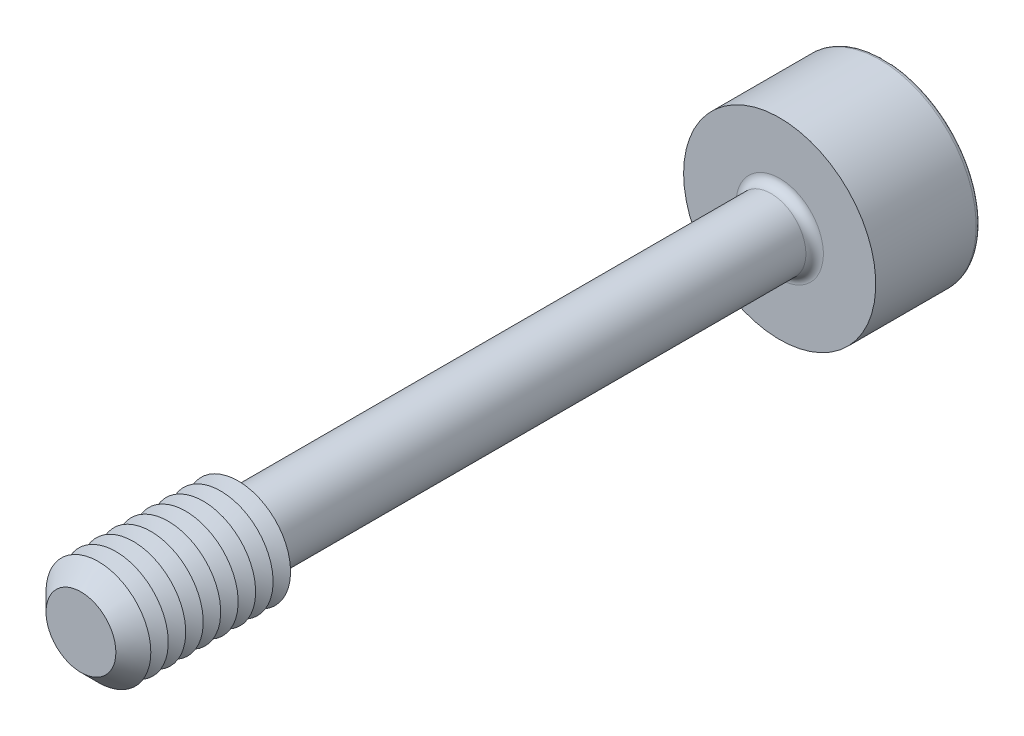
ISO-10303-21;
HEADER;
FILE_DESCRIPTION(('STEP AP214'),'2;1');
FILE_NAME('part.step','',(''),(''),'','','');
FILE_SCHEMA(('AUTOMOTIVE_DESIGN { 1 0 10303 214 1 1 1 1 }'));
ENDSEC;
DATA;
#1=APPLICATION_CONTEXT('core data for automotive mechanical design processes');
#2=APPLICATION_PROTOCOL_DEFINITION('international standard','automotive_design',2000,#1);
#3=PRODUCT_CONTEXT('',#1,'mechanical');
#4=PRODUCT('Part','Part','',(#3));
#5=PRODUCT_RELATED_PRODUCT_CATEGORY('part','',(#4));
#6=PRODUCT_DEFINITION_FORMATION('','',#4);
#7=PRODUCT_DEFINITION_CONTEXT('part definition',#1,'design');
#8=PRODUCT_DEFINITION('design','',#6,#7);
#9=PRODUCT_DEFINITION_SHAPE('','',#8);
#10=(LENGTH_UNIT() NAMED_UNIT(*) SI_UNIT(.MILLI.,.METRE.));
#11=(NAMED_UNIT(*) PLANE_ANGLE_UNIT() SI_UNIT($,.RADIAN.));
#12=(NAMED_UNIT(*) SI_UNIT($,.STERADIAN.) SOLID_ANGLE_UNIT());
#13=UNCERTAINTY_MEASURE_WITH_UNIT(LENGTH_MEASURE(1.E-05),#10,'distance_accuracy_value','');
#14=(GEOMETRIC_REPRESENTATION_CONTEXT(3) GLOBAL_UNCERTAINTY_ASSIGNED_CONTEXT((#13)) GLOBAL_UNIT_ASSIGNED_CONTEXT((#10,
#11,#12)) REPRESENTATION_CONTEXT('',''));
#15=CARTESIAN_POINT('',(0.,0.,0.));
#16=DIRECTION('',(0.,0.,1.));
#17=DIRECTION('',(1.,0.,0.));
#18=AXIS2_PLACEMENT_3D('',#15,#16,#17);
#19=CARTESIAN_POINT('',(-0.721687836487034,-1.25,-10.5));
#20=DIRECTION('',(0.,0.,1.));
#21=DIRECTION('',(1.,0.,0.));
#22=AXIS2_PLACEMENT_3D('',#19,#20,#21);
#23=PLANE('',#22);
#24=DIRECTION('',(1.,0.,0.));
#25=VECTOR('',#24,1.);
#26=CARTESIAN_POINT('',(-0.721687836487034,-1.25,-10.5));
#27=LINE('',#26,#25);
#28=CARTESIAN_POINT('',(0.,-1.25,-10.5));
#29=VERTEX_POINT('',#28);
#30=CARTESIAN_POINT('',(0.721687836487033,-1.25,-10.5));
#31=VERTEX_POINT('',#30);
#32=EDGE_CURVE('E413',#29,#31,#27,.T.);
#33=ORIENTED_EDGE('',*,*,#32,.F.);
#34=CARTESIAN_POINT('',(0.,0.,-10.5));
#35=DIRECTION('',(0.,0.,1.));
#36=DIRECTION('',(0.,-1.,0.));
#37=AXIS2_PLACEMENT_3D('',#34,#35,#36);
#38=CIRCLE('',#37,1.25);
#39=CARTESIAN_POINT('',(1.08253175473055,-0.624999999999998,-10.5));
#40=VERTEX_POINT('',#39);
#41=EDGE_CURVE('E53',#29,#40,#38,.T.);
#42=ORIENTED_EDGE('',*,*,#41,.T.);
#43=DIRECTION('',(0.499999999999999,0.866025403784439,0.));
#44=VECTOR('',#43,1.);
#45=CARTESIAN_POINT('',(0.721687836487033,-1.25,-10.5));
#46=LINE('',#45,#44);
#47=EDGE_CURVE('E402',#31,#40,#46,.T.);
#48=ORIENTED_EDGE('',*,*,#47,.F.);
#49=EDGE_LOOP('',(#33,#42,#48));
#50=FACE_BOUND('',#49,.T.);
#51=ADVANCED_FACE('F41',(#50),#23,.F.);
#52=CARTESIAN_POINT('',(1.44337567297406,0.,-10.5));
#53=VERTEX_POINT('',#52);
#54=EDGE_CURVE('E407',#40,#53,#46,.T.);
#55=ORIENTED_EDGE('',*,*,#54,.F.);
#56=CARTESIAN_POINT('',(1.08253175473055,0.625000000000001,-10.5));
#57=VERTEX_POINT('',#56);
#58=EDGE_CURVE('E11',#40,#57,#38,.T.);
#59=ORIENTED_EDGE('',*,*,#58,.T.);
#60=DIRECTION('',(-0.499999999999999,0.866025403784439,0.));
#61=VECTOR('',#60,1.);
#62=CARTESIAN_POINT('',(1.44337567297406,0.,-10.5));
#63=LINE('',#62,#61);
#64=EDGE_CURVE('E398',#53,#57,#63,.T.);
#65=ORIENTED_EDGE('',*,*,#64,.F.);
#66=EDGE_LOOP('',(#55,#59,#65));
#67=FACE_BOUND('',#66,.T.);
#68=ADVANCED_FACE('F133',(#67),#23,.F.);
#69=CARTESIAN_POINT('',(0.721687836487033,1.25,-10.5));
#70=VERTEX_POINT('',#69);
#71=EDGE_CURVE('E397',#57,#70,#63,.T.);
#72=ORIENTED_EDGE('',*,*,#71,.F.);
#73=CARTESIAN_POINT('',(0.,1.25,-10.5));
#74=VERTEX_POINT('',#73);
#75=EDGE_CURVE('E51',#57,#74,#38,.T.);
#76=ORIENTED_EDGE('',*,*,#75,.T.);
#77=DIRECTION('',(-1.,0.,0.));
#78=VECTOR('',#77,1.);
#79=CARTESIAN_POINT('',(0.721687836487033,1.25,-10.5));
#80=LINE('',#79,#78);
#81=EDGE_CURVE('E177',#70,#74,#80,.T.);
#82=ORIENTED_EDGE('',*,*,#81,.F.);
#83=EDGE_LOOP('',(#72,#76,#82));
#84=FACE_BOUND('',#83,.T.);
#85=ADVANCED_FACE('F139',(#84),#23,.F.);
#86=CARTESIAN_POINT('',(-0.721687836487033,1.25,-10.5));
#87=VERTEX_POINT('',#86);
#88=EDGE_CURVE('E405',#74,#87,#80,.T.);
#89=ORIENTED_EDGE('',*,*,#88,.F.);
#90=CARTESIAN_POINT('',(-1.08253175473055,0.625000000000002,-10.5));
#91=VERTEX_POINT('',#90);
#92=EDGE_CURVE('E262',#74,#91,#38,.T.);
#93=ORIENTED_EDGE('',*,*,#92,.T.);
#94=DIRECTION('',(-0.5,-0.866025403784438,0.));
#95=VECTOR('',#94,1.);
#96=CARTESIAN_POINT('',(-0.721687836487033,1.25,-10.5));
#97=LINE('',#96,#95);
#98=EDGE_CURVE('E176',#87,#91,#97,.T.);
#99=ORIENTED_EDGE('',*,*,#98,.F.);
#100=EDGE_LOOP('',(#89,#93,#99));
#101=FACE_BOUND('',#100,.T.);
#102=ADVANCED_FACE('F157',(#101),#23,.F.);
#103=CARTESIAN_POINT('',(-1.44337567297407,0.,-10.5));
#104=VERTEX_POINT('',#103);
#105=EDGE_CURVE('E170',#91,#104,#97,.T.);
#106=ORIENTED_EDGE('',*,*,#105,.F.);
#107=CARTESIAN_POINT('',(-1.08253175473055,-0.624999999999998,-10.5));
#108=VERTEX_POINT('',#107);
#109=EDGE_CURVE('E172',#91,#108,#38,.T.);
#110=ORIENTED_EDGE('',*,*,#109,.T.);
#111=DIRECTION('',(0.5,-0.866025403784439,0.));
#112=VECTOR('',#111,1.);
#113=CARTESIAN_POINT('',(-1.44337567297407,0.,-10.5));
#114=LINE('',#113,#112);
#115=EDGE_CURVE('E174',#104,#108,#114,.T.);
#116=ORIENTED_EDGE('',*,*,#115,.F.);
#117=EDGE_LOOP('',(#106,#110,#116));
#118=FACE_BOUND('',#117,.T.);
#119=ADVANCED_FACE('F146',(#118),#23,.F.);
#120=CARTESIAN_POINT('',(0.,0.,-13.));
#121=DIRECTION('',(0.,0.,-1.));
#122=DIRECTION('',(-1.,0.,0.));
#123=AXIS2_PLACEMENT_3D('',#120,#121,#122);
#124=PLANE('',#123);
#125=CARTESIAN_POINT('',(0.,0.,-13.));
#126=DIRECTION('',(0.,0.,-1.));
#127=DIRECTION('',(-1.,0.,0.));
#128=AXIS2_PLACEMENT_3D('',#125,#126,#127);
#129=CIRCLE('',#128,2.625);
#130=CARTESIAN_POINT('',(-2.625,0.,-13.));
#131=VERTEX_POINT('',#130);
#132=EDGE_CURVE('E249',#131,#131,#129,.T.);
#133=ORIENTED_EDGE('',*,*,#132,.T.);
#134=EDGE_LOOP('',(#133));
#135=FACE_BOUND('',#134,.T.);
#136=DIRECTION('',(-0.5,-0.866025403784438,0.));
#137=VECTOR('',#136,1.);
#138=CARTESIAN_POINT('',(-0.721687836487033,1.25,-13.));
#139=LINE('',#138,#137);
#140=CARTESIAN_POINT('',(-0.721687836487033,1.25,-13.));
#141=VERTEX_POINT('',#140);
#142=CARTESIAN_POINT('',(-1.44337567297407,0.,-13.));
#143=VERTEX_POINT('',#142);
#144=EDGE_CURVE('E211',#141,#143,#139,.T.);
#145=ORIENTED_EDGE('',*,*,#144,.T.);
#146=DIRECTION('',(0.5,-0.866025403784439,0.));
#147=VECTOR('',#146,1.);
#148=CARTESIAN_POINT('',(-1.44337567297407,0.,-13.));
#149=LINE('',#148,#147);
#150=CARTESIAN_POINT('',(-0.721687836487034,-1.25,-13.));
#151=VERTEX_POINT('',#150);
#152=EDGE_CURVE('E67',#143,#151,#149,.T.);
#153=ORIENTED_EDGE('',*,*,#152,.T.);
#154=DIRECTION('',(1.,0.,0.));
#155=VECTOR('',#154,1.);
#156=CARTESIAN_POINT('',(-0.721687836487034,-1.25,-13.));
#157=LINE('',#156,#155);
#158=CARTESIAN_POINT('',(0.721687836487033,-1.25,-13.));
#159=VERTEX_POINT('',#158);
#160=EDGE_CURVE('E196',#151,#159,#157,.T.);
#161=ORIENTED_EDGE('',*,*,#160,.T.);
#162=DIRECTION('',(0.499999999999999,0.866025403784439,0.));
#163=VECTOR('',#162,1.);
#164=CARTESIAN_POINT('',(0.721687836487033,-1.25,-13.));
#165=LINE('',#164,#163);
#166=CARTESIAN_POINT('',(1.44337567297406,0.,-13.));
#167=VERTEX_POINT('',#166);
#168=EDGE_CURVE('E199',#159,#167,#165,.T.);
#169=ORIENTED_EDGE('',*,*,#168,.T.);
#170=DIRECTION('',(-0.499999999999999,0.866025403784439,0.));
#171=VECTOR('',#170,1.);
#172=CARTESIAN_POINT('',(1.44337567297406,0.,-13.));
#173=LINE('',#172,#171);
#174=CARTESIAN_POINT('',(0.721687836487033,1.25,-13.));
#175=VERTEX_POINT('',#174);
#176=EDGE_CURVE('E203',#167,#175,#173,.T.);
#177=ORIENTED_EDGE('',*,*,#176,.T.);
#178=DIRECTION('',(-1.,0.,0.));
#179=VECTOR('',#178,1.);
#180=CARTESIAN_POINT('',(0.721687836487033,1.25,-13.));
#181=LINE('',#180,#179);
#182=EDGE_CURVE('E207',#175,#141,#181,.T.);
#183=ORIENTED_EDGE('',*,*,#182,.T.);
#184=EDGE_LOOP('',(#145,#153,#161,#169,#177,#183));
#185=FACE_BOUND('',#184,.T.);
#186=ADVANCED_FACE('F156',(#135,#185),#124,.T.);
#187=CARTESIAN_POINT('',(0.,0.,10.));
#188=DIRECTION('',(0.,0.,-1.));
#189=DIRECTION('',(-1.,0.,0.));
#190=AXIS2_PLACEMENT_3D('',#187,#188,#189);
#191=CYLINDRICAL_SURFACE('',#190,1.);
#192=CARTESIAN_POINT('',(0.,0.,-9.75));
#193=DIRECTION('',(0.,0.,-1.));
#194=DIRECTION('',(-1.,0.,0.));
#195=AXIS2_PLACEMENT_3D('',#192,#193,#194);
#196=CIRCLE('',#195,1.);
#197=CARTESIAN_POINT('',(-1.,0.,-9.75));
#198=VERTEX_POINT('',#197);
#199=EDGE_CURVE('E246',#198,#198,#196,.F.);
#200=ORIENTED_EDGE('',*,*,#199,.T.);
#201=EDGE_LOOP('',(#200));
#202=FACE_BOUND('',#201,.T.);
#203=CARTESIAN_POINT('',(0.,0.,5.21132486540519));
#204=DIRECTION('',(0.,0.,-1.));
#205=DIRECTION('',(0.,1.,0.));
#206=AXIS2_PLACEMENT_3D('',#203,#204,#205);
#207=CIRCLE('',#206,1.);
#208=CARTESIAN_POINT('',(0.,1.,5.21132486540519));
#209=VERTEX_POINT('',#208);
#210=EDGE_CURVE('E234',#209,#209,#207,.T.);
#211=ORIENTED_EDGE('',*,*,#210,.T.);
#212=EDGE_LOOP('',(#211));
#213=FACE_BOUND('',#212,.T.);
#214=ADVANCED_FACE('F163',(#202,#213),#191,.T.);
#215=CARTESIAN_POINT('',(0.,0.,5.21132486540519));
#216=DIRECTION('',(0.,0.,1.));
#217=DIRECTION('',(0.,-1.,0.));
#218=AXIS2_PLACEMENT_3D('',#215,#216,#217);
#219=CONICAL_SURFACE('',#218,1.,1.0471975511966);
#220=CARTESIAN_POINT('',(0.,0.,5.5));
#221=DIRECTION('',(0.,0.,-1.));
#222=DIRECTION('',(-1.,0.,0.));
#223=AXIS2_PLACEMENT_3D('',#220,#221,#222);
#224=CIRCLE('',#223,1.5);
#225=CARTESIAN_POINT('',(-1.5,0.,5.5));
#226=VERTEX_POINT('',#225);
#227=EDGE_CURVE('E266',#226,#226,#224,.T.);
#228=ORIENTED_EDGE('',*,*,#227,.T.);
#229=EDGE_LOOP('',(#228));
#230=FACE_BOUND('',#229,.T.);
#231=ORIENTED_EDGE('',*,*,#210,.F.);
#232=EDGE_LOOP('',(#231));
#233=FACE_BOUND('',#232,.T.);
#234=ADVANCED_FACE('F355',(#230,#233),#219,.T.);
#235=CARTESIAN_POINT('',(0.,0.,-10.));
#236=DIRECTION('',(0.,0.,-1.));
#237=DIRECTION('',(-1.,0.,0.));
#238=AXIS2_PLACEMENT_3D('',#235,#236,#237);
#239=PLANE('',#238);
#240=CARTESIAN_POINT('',(0.,0.,-10.));
#241=DIRECTION('',(0.,0.,-1.));
#242=DIRECTION('',(-1.,0.,0.));
#243=AXIS2_PLACEMENT_3D('',#240,#241,#242);
#244=CIRCLE('',#243,1.25);
#245=CARTESIAN_POINT('',(-1.25,0.,-10.));
#246=VERTEX_POINT('',#245);
#247=EDGE_CURVE('E242',#246,#246,#244,.T.);
#248=ORIENTED_EDGE('',*,*,#247,.T.);
#249=EDGE_LOOP('',(#248));
#250=FACE_BOUND('',#249,.T.);
#251=CARTESIAN_POINT('',(0.,0.,-10.));
#252=DIRECTION('',(0.,0.,-1.));
#253=DIRECTION('',(-1.,0.,0.));
#254=AXIS2_PLACEMENT_3D('',#251,#252,#253);
#255=CIRCLE('',#254,2.75);
#256=CARTESIAN_POINT('',(-2.75,0.,-10.));
#257=VERTEX_POINT('',#256);
#258=EDGE_CURVE('E230',#257,#257,#255,.T.);
#259=ORIENTED_EDGE('',*,*,#258,.F.);
#260=EDGE_LOOP('',(#259));
#261=FACE_BOUND('',#260,.T.);
#262=ADVANCED_FACE('F360',(#250,#261),#239,.F.);
#263=CARTESIAN_POINT('',(0.,0.,-13.));
#264=DIRECTION('',(0.,0.,1.));
#265=DIRECTION('',(1.,0.,0.));
#266=AXIS2_PLACEMENT_3D('',#263,#264,#265);
#267=CYLINDRICAL_SURFACE('',#266,2.75);
#268=CARTESIAN_POINT('',(0.,0.,-12.875));
#269=DIRECTION('',(0.,0.,-1.));
#270=DIRECTION('',(-1.,0.,0.));
#271=AXIS2_PLACEMENT_3D('',#268,#269,#270);
#272=CIRCLE('',#271,2.75);
#273=CARTESIAN_POINT('',(-2.75,0.,-12.875));
#274=VERTEX_POINT('',#273);
#275=EDGE_CURVE('E45',#274,#274,#272,.F.);
#276=ORIENTED_EDGE('',*,*,#275,.T.);
#277=EDGE_LOOP('',(#276));
#278=FACE_BOUND('',#277,.T.);
#279=ORIENTED_EDGE('',*,*,#258,.T.);
#280=EDGE_LOOP('',(#279));
#281=FACE_BOUND('',#280,.T.);
#282=ADVANCED_FACE('F361',(#278,#281),#267,.T.);
#283=CARTESIAN_POINT('',(-1.44337567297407,0.,-10.5));
#284=DIRECTION('',(0.866025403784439,0.5,0.));
#285=DIRECTION('',(-0.5,0.866025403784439,0.));
#286=AXIS2_PLACEMENT_3D('',#283,#284,#285);
#287=PLANE('',#286);
#288=ORIENTED_EDGE('',*,*,#152,.F.);
#289=DIRECTION('',(0.,0.,-1.));
#290=VECTOR('',#289,1.);
#291=CARTESIAN_POINT('',(-1.44337567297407,0.,-10.5));
#292=LINE('',#291,#290);
#293=EDGE_CURVE('E186',#104,#143,#292,.T.);
#294=ORIENTED_EDGE('',*,*,#293,.F.);
#295=ORIENTED_EDGE('',*,*,#115,.T.);
#296=CARTESIAN_POINT('',(-0.721687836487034,-1.25,-10.5));
#297=VERTEX_POINT('',#296);
#298=EDGE_CURVE('E214',#108,#297,#114,.T.);
#299=ORIENTED_EDGE('',*,*,#298,.T.);
#300=DIRECTION('',(0.,0.,-1.));
#301=VECTOR('',#300,1.);
#302=CARTESIAN_POINT('',(-0.721687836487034,-1.25,-10.5));
#303=LINE('',#302,#301);
#304=EDGE_CURVE('E227',#297,#151,#303,.T.);
#305=ORIENTED_EDGE('',*,*,#304,.T.);
#306=EDGE_LOOP('',(#288,#294,#295,#299,#305));
#307=FACE_BOUND('',#306,.T.);
#308=ADVANCED_FACE('F364',(#307),#287,.T.);
#309=CARTESIAN_POINT('',(-0.721687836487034,-1.25,-10.5));
#310=DIRECTION('',(0.,1.,0.));
#311=DIRECTION('',(0.,0.,1.));
#312=AXIS2_PLACEMENT_3D('',#309,#310,#311);
#313=PLANE('',#312);
#314=ORIENTED_EDGE('',*,*,#160,.F.);
#315=ORIENTED_EDGE('',*,*,#304,.F.);
#316=EDGE_CURVE('E410',#297,#29,#27,.T.);
#317=ORIENTED_EDGE('',*,*,#316,.T.);
#318=ORIENTED_EDGE('',*,*,#32,.T.);
#319=DIRECTION('',(0.,0.,-1.));
#320=VECTOR('',#319,1.);
#321=CARTESIAN_POINT('',(0.721687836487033,-1.25,-10.5));
#322=LINE('',#321,#320);
#323=EDGE_CURVE('E224',#31,#159,#322,.T.);
#324=ORIENTED_EDGE('',*,*,#323,.T.);
#325=EDGE_LOOP('',(#314,#315,#317,#318,#324));
#326=FACE_BOUND('',#325,.T.);
#327=ADVANCED_FACE('F370',(#326),#313,.T.);
#328=CARTESIAN_POINT('',(0.721687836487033,-1.25,-10.5));
#329=DIRECTION('',(-0.866025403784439,0.499999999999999,0.));
#330=DIRECTION('',(-0.499999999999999,-0.866025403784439,0.));
#331=AXIS2_PLACEMENT_3D('',#328,#329,#330);
#332=PLANE('',#331);
#333=ORIENTED_EDGE('',*,*,#168,.F.);
#334=ORIENTED_EDGE('',*,*,#323,.F.);
#335=ORIENTED_EDGE('',*,*,#47,.T.);
#336=ORIENTED_EDGE('',*,*,#54,.T.);
#337=DIRECTION('',(0.,0.,-1.));
#338=VECTOR('',#337,1.);
#339=CARTESIAN_POINT('',(1.44337567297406,0.,-10.5));
#340=LINE('',#339,#338);
#341=EDGE_CURVE('E221',#53,#167,#340,.T.);
#342=ORIENTED_EDGE('',*,*,#341,.T.);
#343=EDGE_LOOP('',(#333,#334,#335,#336,#342));
#344=FACE_BOUND('',#343,.T.);
#345=ADVANCED_FACE('F373',(#344),#332,.T.);
#346=CARTESIAN_POINT('',(1.44337567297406,0.,-10.5));
#347=DIRECTION('',(-0.866025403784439,-0.5,0.));
#348=DIRECTION('',(0.5,-0.866025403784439,0.));
#349=AXIS2_PLACEMENT_3D('',#346,#347,#348);
#350=PLANE('',#349);
#351=ORIENTED_EDGE('',*,*,#176,.F.);
#352=ORIENTED_EDGE('',*,*,#341,.F.);
#353=ORIENTED_EDGE('',*,*,#64,.T.);
#354=ORIENTED_EDGE('',*,*,#71,.T.);
#355=DIRECTION('',(0.,0.,-1.));
#356=VECTOR('',#355,1.);
#357=CARTESIAN_POINT('',(0.721687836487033,1.25,-10.5));
#358=LINE('',#357,#356);
#359=EDGE_CURVE('E218',#70,#175,#358,.T.);
#360=ORIENTED_EDGE('',*,*,#359,.T.);
#361=EDGE_LOOP('',(#351,#352,#353,#354,#360));
#362=FACE_BOUND('',#361,.T.);
#363=ADVANCED_FACE('F377',(#362),#350,.T.);
#364=CARTESIAN_POINT('',(0.721687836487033,1.25,-10.5));
#365=DIRECTION('',(0.,-1.,0.));
#366=DIRECTION('',(1.,0.,0.));
#367=AXIS2_PLACEMENT_3D('',#364,#365,#366);
#368=PLANE('',#367);
#369=ORIENTED_EDGE('',*,*,#182,.F.);
#370=ORIENTED_EDGE('',*,*,#359,.F.);
#371=ORIENTED_EDGE('',*,*,#81,.T.);
#372=ORIENTED_EDGE('',*,*,#88,.T.);
#373=DIRECTION('',(0.,0.,-1.));
#374=VECTOR('',#373,1.);
#375=CARTESIAN_POINT('',(-0.721687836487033,1.25,-10.5));
#376=LINE('',#375,#374);
#377=EDGE_CURVE('E182',#87,#141,#376,.T.);
#378=ORIENTED_EDGE('',*,*,#377,.T.);
#379=EDGE_LOOP('',(#369,#370,#371,#372,#378));
#380=FACE_BOUND('',#379,.T.);
#381=ADVANCED_FACE('F152',(#380),#368,.T.);
#382=CARTESIAN_POINT('',(-0.721687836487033,1.25,-10.5));
#383=DIRECTION('',(0.866025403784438,-0.5,0.));
#384=DIRECTION('',(0.5,0.866025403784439,0.));
#385=AXIS2_PLACEMENT_3D('',#382,#383,#384);
#386=PLANE('',#385);
#387=ORIENTED_EDGE('',*,*,#144,.F.);
#388=ORIENTED_EDGE('',*,*,#377,.F.);
#389=ORIENTED_EDGE('',*,*,#98,.T.);
#390=ORIENTED_EDGE('',*,*,#105,.T.);
#391=ORIENTED_EDGE('',*,*,#293,.T.);
#392=EDGE_LOOP('',(#387,#388,#389,#390,#391));
#393=FACE_BOUND('',#392,.T.);
#394=ADVANCED_FACE('F144',(#393),#386,.T.);
#395=ORIENTED_EDGE('',*,*,#298,.F.);
#396=EDGE_CURVE('E256',#108,#29,#38,.T.);
#397=ORIENTED_EDGE('',*,*,#396,.T.);
#398=ORIENTED_EDGE('',*,*,#316,.F.);
#399=EDGE_LOOP('',(#395,#397,#398));
#400=FACE_BOUND('',#399,.T.);
#401=ADVANCED_FACE('F135',(#400),#23,.F.);
#402=CARTESIAN_POINT('',(0.,0.,-9.75));
#403=DIRECTION('',(0.,0.,-1.));
#404=DIRECTION('',(-1.,0.,0.));
#405=AXIS2_PLACEMENT_3D('',#402,#403,#404);
#406=TOROIDAL_SURFACE('',#405,1.25,0.25);
#407=ORIENTED_EDGE('',*,*,#199,.F.);
#408=EDGE_LOOP('',(#407));
#409=FACE_BOUND('',#408,.T.);
#410=ORIENTED_EDGE('',*,*,#247,.F.);
#411=EDGE_LOOP('',(#410));
#412=FACE_BOUND('',#411,.T.);
#413=ADVANCED_FACE('F129',(#409,#412),#406,.F.);
#414=CARTESIAN_POINT('',(0.,0.,-12.875));
#415=DIRECTION('',(0.,0.,-1.));
#416=DIRECTION('',(-1.,0.,0.));
#417=AXIS2_PLACEMENT_3D('',#414,#415,#416);
#418=TOROIDAL_SURFACE('',#417,2.625,0.125);
#419=ORIENTED_EDGE('',*,*,#275,.F.);
#420=EDGE_LOOP('',(#419));
#421=FACE_BOUND('',#420,.T.);
#422=ORIENTED_EDGE('',*,*,#132,.F.);
#423=EDGE_LOOP('',(#422));
#424=FACE_BOUND('',#423,.T.);
#425=ADVANCED_FACE('F43',(#421,#424),#418,.T.);
#426=CARTESIAN_POINT('',(0.,0.,-9.77831216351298));
#427=DIRECTION('',(0.,0.,-1.));
#428=DIRECTION('',(0.,1.,0.));
#429=AXIS2_PLACEMENT_3D('',#426,#427,#428);
#430=CONICAL_SURFACE('',#429,0.,1.0471975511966);
#431=ORIENTED_EDGE('',*,*,#41,.F.);
#432=ORIENTED_EDGE('',*,*,#396,.F.);
#433=ORIENTED_EDGE('',*,*,#109,.F.);
#434=ORIENTED_EDGE('',*,*,#92,.F.);
#435=ORIENTED_EDGE('',*,*,#75,.F.);
#436=ORIENTED_EDGE('',*,*,#58,.F.);
#437=EDGE_LOOP('',(#431,#432,#433,#434,#435,#436));
#438=FACE_BOUND('',#437,.T.);
#439=CARTESIAN_POINT('',(0.,0.,-9.77831216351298));
#440=VERTEX_POINT('',#439);
#441=VERTEX_LOOP('',#440);
#442=FACE_BOUND('',#441,.T.);
#443=ADVANCED_FACE('F118',(#438,#442),#430,.F.);
#444=CARTESIAN_POINT('',(0.,0.,5.75));
#445=DIRECTION('',(0.,0.,-1.));
#446=DIRECTION('',(-1.,0.,0.));
#447=AXIS2_PLACEMENT_3D('',#444,#445,#446);
#448=CONICAL_SURFACE('',#447,1.06698729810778,1.0471975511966);
#449=ORIENTED_EDGE('',*,*,#227,.F.);
#450=EDGE_LOOP('',(#449));
#451=FACE_BOUND('',#450,.T.);
#452=CARTESIAN_POINT('',(0.,0.,5.75));
#453=DIRECTION('',(0.,0.,-1.));
#454=DIRECTION('',(-1.,0.,0.));
#455=AXIS2_PLACEMENT_3D('',#452,#453,#454);
#456=CIRCLE('',#455,1.06698729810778);
#457=CARTESIAN_POINT('',(-1.06698729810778,0.,5.75));
#458=VERTEX_POINT('',#457);
#459=EDGE_CURVE('E272',#458,#458,#456,.T.);
#460=ORIENTED_EDGE('',*,*,#459,.T.);
#461=EDGE_LOOP('',(#460));
#462=FACE_BOUND('',#461,.T.);
#463=ADVANCED_FACE('F120',(#451,#462),#448,.T.);
#464=CARTESIAN_POINT('',(0.,0.,6.));
#465=DIRECTION('',(0.,0.,1.));
#466=DIRECTION('',(1.,0.,0.));
#467=AXIS2_PLACEMENT_3D('',#464,#465,#466);
#468=CONICAL_SURFACE('',#467,1.5,1.0471975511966);
#469=ORIENTED_EDGE('',*,*,#459,.F.);
#470=EDGE_LOOP('',(#469));
#471=FACE_BOUND('',#470,.T.);
#472=CARTESIAN_POINT('',(0.,0.,6.));
#473=DIRECTION('',(0.,0.,-1.));
#474=DIRECTION('',(-1.,0.,0.));
#475=AXIS2_PLACEMENT_3D('',#472,#473,#474);
#476=CIRCLE('',#475,1.5);
#477=CARTESIAN_POINT('',(-1.5,0.,6.));
#478=VERTEX_POINT('',#477);
#479=EDGE_CURVE('E278',#478,#478,#476,.T.);
#480=ORIENTED_EDGE('',*,*,#479,.T.);
#481=EDGE_LOOP('',(#480));
#482=FACE_BOUND('',#481,.T.);
#483=ADVANCED_FACE('F126',(#471,#482),#468,.T.);
#484=CARTESIAN_POINT('',(0.,0.,6.25));
#485=DIRECTION('',(0.,0.,-1.));
#486=DIRECTION('',(-1.,0.,0.));
#487=AXIS2_PLACEMENT_3D('',#484,#485,#486);
#488=CONICAL_SURFACE('',#487,1.06698729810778,1.0471975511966);
#489=ORIENTED_EDGE('',*,*,#479,.F.);
#490=EDGE_LOOP('',(#489));
#491=FACE_BOUND('',#490,.T.);
#492=CARTESIAN_POINT('',(0.,0.,6.25));
#493=DIRECTION('',(0.,0.,-1.));
#494=DIRECTION('',(-1.,0.,0.));
#495=AXIS2_PLACEMENT_3D('',#492,#493,#494);
#496=CIRCLE('',#495,1.06698729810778);
#497=CARTESIAN_POINT('',(-1.06698729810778,0.,6.25));
#498=VERTEX_POINT('',#497);
#499=EDGE_CURVE('E284',#498,#498,#496,.T.);
#500=ORIENTED_EDGE('',*,*,#499,.T.);
#501=EDGE_LOOP('',(#500));
#502=FACE_BOUND('',#501,.T.);
#503=ADVANCED_FACE('F516',(#491,#502),#488,.T.);
#504=CARTESIAN_POINT('',(0.,0.,6.5));
#505=DIRECTION('',(0.,0.,1.));
#506=DIRECTION('',(1.,0.,0.));
#507=AXIS2_PLACEMENT_3D('',#504,#505,#506);
#508=CONICAL_SURFACE('',#507,1.5,1.0471975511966);
#509=ORIENTED_EDGE('',*,*,#499,.F.);
#510=EDGE_LOOP('',(#509));
#511=FACE_BOUND('',#510,.T.);
#512=CARTESIAN_POINT('',(0.,0.,6.5));
#513=DIRECTION('',(0.,0.,-1.));
#514=DIRECTION('',(-1.,0.,0.));
#515=AXIS2_PLACEMENT_3D('',#512,#513,#514);
#516=CIRCLE('',#515,1.5);
#517=CARTESIAN_POINT('',(-1.5,0.,6.5));
#518=VERTEX_POINT('',#517);
#519=EDGE_CURVE('E288',#518,#518,#516,.T.);
#520=ORIENTED_EDGE('',*,*,#519,.T.);
#521=EDGE_LOOP('',(#520));
#522=FACE_BOUND('',#521,.T.);
#523=ADVANCED_FACE('F525',(#511,#522),#508,.T.);
#524=CARTESIAN_POINT('',(0.,0.,6.75));
#525=DIRECTION('',(0.,0.,-1.));
#526=DIRECTION('',(-1.,0.,0.));
#527=AXIS2_PLACEMENT_3D('',#524,#525,#526);
#528=CONICAL_SURFACE('',#527,1.06698729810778,1.0471975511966);
#529=ORIENTED_EDGE('',*,*,#519,.F.);
#530=EDGE_LOOP('',(#529));
#531=FACE_BOUND('',#530,.T.);
#532=CARTESIAN_POINT('',(0.,0.,6.75));
#533=DIRECTION('',(0.,0.,-1.));
#534=DIRECTION('',(-1.,0.,0.));
#535=AXIS2_PLACEMENT_3D('',#532,#533,#534);
#536=CIRCLE('',#535,1.06698729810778);
#537=CARTESIAN_POINT('',(-1.06698729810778,0.,6.75));
#538=VERTEX_POINT('',#537);
#539=EDGE_CURVE('E292',#538,#538,#536,.T.);
#540=ORIENTED_EDGE('',*,*,#539,.T.);
#541=EDGE_LOOP('',(#540));
#542=FACE_BOUND('',#541,.T.);
#543=ADVANCED_FACE('F534',(#531,#542),#528,.T.);
#544=CARTESIAN_POINT('',(0.,0.,7.));
#545=DIRECTION('',(0.,0.,1.));
#546=DIRECTION('',(1.,0.,0.));
#547=AXIS2_PLACEMENT_3D('',#544,#545,#546);
#548=CONICAL_SURFACE('',#547,1.5,1.0471975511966);
#549=ORIENTED_EDGE('',*,*,#539,.F.);
#550=EDGE_LOOP('',(#549));
#551=FACE_BOUND('',#550,.T.);
#552=CARTESIAN_POINT('',(0.,0.,7.));
#553=DIRECTION('',(0.,0.,-1.));
#554=DIRECTION('',(-1.,0.,0.));
#555=AXIS2_PLACEMENT_3D('',#552,#553,#554);
#556=CIRCLE('',#555,1.5);
#557=CARTESIAN_POINT('',(-1.5,0.,7.));
#558=VERTEX_POINT('',#557);
#559=EDGE_CURVE('E295',#558,#558,#556,.T.);
#560=ORIENTED_EDGE('',*,*,#559,.T.);
#561=EDGE_LOOP('',(#560));
#562=FACE_BOUND('',#561,.T.);
#563=ADVANCED_FACE('F543',(#551,#562),#548,.T.);
#564=CARTESIAN_POINT('',(0.,0.,7.25));
#565=DIRECTION('',(0.,0.,-1.));
#566=DIRECTION('',(-1.,0.,0.));
#567=AXIS2_PLACEMENT_3D('',#564,#565,#566);
#568=CONICAL_SURFACE('',#567,1.06698729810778,1.0471975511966);
#569=ORIENTED_EDGE('',*,*,#559,.F.);
#570=EDGE_LOOP('',(#569));
#571=FACE_BOUND('',#570,.T.);
#572=CARTESIAN_POINT('',(0.,0.,7.25));
#573=DIRECTION('',(0.,0.,-1.));
#574=DIRECTION('',(-1.,0.,0.));
#575=AXIS2_PLACEMENT_3D('',#572,#573,#574);
#576=CIRCLE('',#575,1.06698729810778);
#577=CARTESIAN_POINT('',(-1.06698729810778,0.,7.25));
#578=VERTEX_POINT('',#577);
#579=EDGE_CURVE('E299',#578,#578,#576,.T.);
#580=ORIENTED_EDGE('',*,*,#579,.T.);
#581=EDGE_LOOP('',(#580));
#582=FACE_BOUND('',#581,.T.);
#583=ADVANCED_FACE('F552',(#571,#582),#568,.T.);
#584=CARTESIAN_POINT('',(0.,0.,7.5));
#585=DIRECTION('',(0.,0.,1.));
#586=DIRECTION('',(1.,0.,0.));
#587=AXIS2_PLACEMENT_3D('',#584,#585,#586);
#588=CONICAL_SURFACE('',#587,1.5,1.0471975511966);
#589=ORIENTED_EDGE('',*,*,#579,.F.);
#590=EDGE_LOOP('',(#589));
#591=FACE_BOUND('',#590,.T.);
#592=CARTESIAN_POINT('',(0.,0.,7.5));
#593=DIRECTION('',(0.,0.,-1.));
#594=DIRECTION('',(-1.,0.,0.));
#595=AXIS2_PLACEMENT_3D('',#592,#593,#594);
#596=CIRCLE('',#595,1.5);
#597=CARTESIAN_POINT('',(-1.5,0.,7.5));
#598=VERTEX_POINT('',#597);
#599=EDGE_CURVE('E303',#598,#598,#596,.T.);
#600=ORIENTED_EDGE('',*,*,#599,.T.);
#601=EDGE_LOOP('',(#600));
#602=FACE_BOUND('',#601,.T.);
#603=ADVANCED_FACE('F561',(#591,#602),#588,.T.);
#604=CARTESIAN_POINT('',(0.,0.,7.75));
#605=DIRECTION('',(0.,0.,-1.));
#606=DIRECTION('',(-1.,0.,0.));
#607=AXIS2_PLACEMENT_3D('',#604,#605,#606);
#608=CONICAL_SURFACE('',#607,1.06698729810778,1.0471975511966);
#609=ORIENTED_EDGE('',*,*,#599,.F.);
#610=EDGE_LOOP('',(#609));
#611=FACE_BOUND('',#610,.T.);
#612=CARTESIAN_POINT('',(0.,0.,7.75));
#613=DIRECTION('',(0.,0.,-1.));
#614=DIRECTION('',(-1.,0.,0.));
#615=AXIS2_PLACEMENT_3D('',#612,#613,#614);
#616=CIRCLE('',#615,1.06698729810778);
#617=CARTESIAN_POINT('',(-1.06698729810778,0.,7.75));
#618=VERTEX_POINT('',#617);
#619=EDGE_CURVE('E307',#618,#618,#616,.T.);
#620=ORIENTED_EDGE('',*,*,#619,.T.);
#621=EDGE_LOOP('',(#620));
#622=FACE_BOUND('',#621,.T.);
#623=ADVANCED_FACE('F570',(#611,#622),#608,.T.);
#624=CARTESIAN_POINT('',(0.,0.,8.));
#625=DIRECTION('',(0.,0.,1.));
#626=DIRECTION('',(1.,0.,0.));
#627=AXIS2_PLACEMENT_3D('',#624,#625,#626);
#628=CONICAL_SURFACE('',#627,1.5,1.0471975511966);
#629=ORIENTED_EDGE('',*,*,#619,.F.);
#630=EDGE_LOOP('',(#629));
#631=FACE_BOUND('',#630,.T.);
#632=CARTESIAN_POINT('',(0.,0.,8.));
#633=DIRECTION('',(0.,0.,-1.));
#634=DIRECTION('',(-1.,0.,0.));
#635=AXIS2_PLACEMENT_3D('',#632,#633,#634);
#636=CIRCLE('',#635,1.5);
#637=CARTESIAN_POINT('',(-1.5,0.,8.));
#638=VERTEX_POINT('',#637);
#639=EDGE_CURVE('E311',#638,#638,#636,.T.);
#640=ORIENTED_EDGE('',*,*,#639,.T.);
#641=EDGE_LOOP('',(#640));
#642=FACE_BOUND('',#641,.T.);
#643=ADVANCED_FACE('F579',(#631,#642),#628,.T.);
#644=CARTESIAN_POINT('',(0.,0.,8.25));
#645=DIRECTION('',(0.,0.,-1.));
#646=DIRECTION('',(-1.,0.,0.));
#647=AXIS2_PLACEMENT_3D('',#644,#645,#646);
#648=CONICAL_SURFACE('',#647,1.06698729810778,1.0471975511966);
#649=ORIENTED_EDGE('',*,*,#639,.F.);
#650=EDGE_LOOP('',(#649));
#651=FACE_BOUND('',#650,.T.);
#652=CARTESIAN_POINT('',(0.,0.,8.25));
#653=DIRECTION('',(0.,0.,-1.));
#654=DIRECTION('',(-1.,0.,0.));
#655=AXIS2_PLACEMENT_3D('',#652,#653,#654);
#656=CIRCLE('',#655,1.06698729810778);
#657=CARTESIAN_POINT('',(-1.06698729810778,0.,8.25));
#658=VERTEX_POINT('',#657);
#659=EDGE_CURVE('E314',#658,#658,#656,.T.);
#660=ORIENTED_EDGE('',*,*,#659,.T.);
#661=EDGE_LOOP('',(#660));
#662=FACE_BOUND('',#661,.T.);
#663=ADVANCED_FACE('F588',(#651,#662),#648,.T.);
#664=CARTESIAN_POINT('',(0.,0.,8.5));
#665=DIRECTION('',(0.,0.,1.));
#666=DIRECTION('',(1.,0.,0.));
#667=AXIS2_PLACEMENT_3D('',#664,#665,#666);
#668=CONICAL_SURFACE('',#667,1.5,1.0471975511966);
#669=ORIENTED_EDGE('',*,*,#659,.F.);
#670=EDGE_LOOP('',(#669));
#671=FACE_BOUND('',#670,.T.);
#672=CARTESIAN_POINT('',(0.,0.,8.5));
#673=DIRECTION('',(0.,0.,-1.));
#674=DIRECTION('',(-1.,0.,0.));
#675=AXIS2_PLACEMENT_3D('',#672,#673,#674);
#676=CIRCLE('',#675,1.5);
#677=CARTESIAN_POINT('',(-1.5,0.,8.5));
#678=VERTEX_POINT('',#677);
#679=EDGE_CURVE('E318',#678,#678,#676,.T.);
#680=ORIENTED_EDGE('',*,*,#679,.T.);
#681=EDGE_LOOP('',(#680));
#682=FACE_BOUND('',#681,.T.);
#683=ADVANCED_FACE('F597',(#671,#682),#668,.T.);
#684=CARTESIAN_POINT('',(0.,0.,8.75));
#685=DIRECTION('',(0.,0.,-1.));
#686=DIRECTION('',(-1.,0.,0.));
#687=AXIS2_PLACEMENT_3D('',#684,#685,#686);
#688=CONICAL_SURFACE('',#687,1.06698729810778,1.0471975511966);
#689=ORIENTED_EDGE('',*,*,#679,.F.);
#690=EDGE_LOOP('',(#689));
#691=FACE_BOUND('',#690,.T.);
#692=CARTESIAN_POINT('',(0.,0.,8.75));
#693=DIRECTION('',(0.,0.,-1.));
#694=DIRECTION('',(-1.,0.,0.));
#695=AXIS2_PLACEMENT_3D('',#692,#693,#694);
#696=CIRCLE('',#695,1.06698729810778);
#697=CARTESIAN_POINT('',(-1.06698729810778,0.,8.75));
#698=VERTEX_POINT('',#697);
#699=EDGE_CURVE('E322',#698,#698,#696,.T.);
#700=ORIENTED_EDGE('',*,*,#699,.T.);
#701=EDGE_LOOP('',(#700));
#702=FACE_BOUND('',#701,.T.);
#703=ADVANCED_FACE('F606',(#691,#702),#688,.T.);
#704=CARTESIAN_POINT('',(0.,0.,9.));
#705=DIRECTION('',(0.,0.,1.));
#706=DIRECTION('',(1.,0.,0.));
#707=AXIS2_PLACEMENT_3D('',#704,#705,#706);
#708=CONICAL_SURFACE('',#707,1.5,1.0471975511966);
#709=ORIENTED_EDGE('',*,*,#699,.F.);
#710=EDGE_LOOP('',(#709));
#711=FACE_BOUND('',#710,.T.);
#712=CARTESIAN_POINT('',(0.,0.,9.));
#713=DIRECTION('',(0.,0.,-1.));
#714=DIRECTION('',(-1.,0.,0.));
#715=AXIS2_PLACEMENT_3D('',#712,#713,#714);
#716=CIRCLE('',#715,1.5);
#717=CARTESIAN_POINT('',(-1.5,0.,9.));
#718=VERTEX_POINT('',#717);
#719=EDGE_CURVE('E326',#718,#718,#716,.T.);
#720=ORIENTED_EDGE('',*,*,#719,.T.);
#721=EDGE_LOOP('',(#720));
#722=FACE_BOUND('',#721,.T.);
#723=ADVANCED_FACE('F615',(#711,#722),#708,.T.);
#724=CARTESIAN_POINT('',(0.,0.,9.25));
#725=DIRECTION('',(0.,0.,-1.));
#726=DIRECTION('',(-1.,0.,0.));
#727=AXIS2_PLACEMENT_3D('',#724,#725,#726);
#728=CONICAL_SURFACE('',#727,1.06698729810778,1.0471975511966);
#729=ORIENTED_EDGE('',*,*,#719,.F.);
#730=EDGE_LOOP('',(#729));
#731=FACE_BOUND('',#730,.T.);
#732=CARTESIAN_POINT('',(0.,0.,9.25));
#733=DIRECTION('',(0.,0.,-1.));
#734=DIRECTION('',(-1.,0.,0.));
#735=AXIS2_PLACEMENT_3D('',#732,#733,#734);
#736=CIRCLE('',#735,1.06698729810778);
#737=CARTESIAN_POINT('',(-1.06698729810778,0.,9.25));
#738=VERTEX_POINT('',#737);
#739=EDGE_CURVE('E330',#738,#738,#736,.T.);
#740=ORIENTED_EDGE('',*,*,#739,.T.);
#741=EDGE_LOOP('',(#740));
#742=FACE_BOUND('',#741,.T.);
#743=ADVANCED_FACE('F624',(#731,#742),#728,.T.);
#744=CARTESIAN_POINT('',(0.,0.,9.5));
#745=DIRECTION('',(0.,0.,1.));
#746=DIRECTION('',(1.,0.,0.));
#747=AXIS2_PLACEMENT_3D('',#744,#745,#746);
#748=CONICAL_SURFACE('',#747,1.5,1.0471975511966);
#749=ORIENTED_EDGE('',*,*,#739,.F.);
#750=EDGE_LOOP('',(#749));
#751=FACE_BOUND('',#750,.T.);
#752=CARTESIAN_POINT('',(0.,0.,9.5));
#753=DIRECTION('',(0.,0.,-1.));
#754=DIRECTION('',(-1.,0.,0.));
#755=AXIS2_PLACEMENT_3D('',#752,#753,#754);
#756=CIRCLE('',#755,1.5);
#757=CARTESIAN_POINT('',(-1.5,0.,9.5));
#758=VERTEX_POINT('',#757);
#759=EDGE_CURVE('E334',#758,#758,#756,.T.);
#760=ORIENTED_EDGE('',*,*,#759,.T.);
#761=EDGE_LOOP('',(#760));
#762=FACE_BOUND('',#761,.T.);
#763=ADVANCED_FACE('F340',(#751,#762),#748,.T.);
#764=CARTESIAN_POINT('',(0.,0.,10.));
#765=DIRECTION('',(0.,0.,1.));
#766=DIRECTION('',(1.,0.,0.));
#767=AXIS2_PLACEMENT_3D('',#764,#765,#766);
#768=PLANE('',#767);
#769=CARTESIAN_POINT('',(0.,0.,10.));
#770=DIRECTION('',(0.,0.,1.));
#771=DIRECTION('',(1.,0.,0.));
#772=AXIS2_PLACEMENT_3D('',#769,#770,#771);
#773=CIRCLE('',#772,0.999999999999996);
#774=CARTESIAN_POINT('',(0.999999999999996,0.,10.));
#775=VERTEX_POINT('',#774);
#776=EDGE_CURVE('E238',#775,#775,#773,.T.);
#777=ORIENTED_EDGE('',*,*,#776,.T.);
#778=EDGE_LOOP('',(#777));
#779=FACE_BOUND('',#778,.T.);
#780=ADVANCED_FACE('F344',(#779),#768,.T.);
#781=CARTESIAN_POINT('',(0.,0.,9.5));
#782=DIRECTION('',(0.,0.,-1.));
#783=DIRECTION('',(0.,1.,0.));
#784=AXIS2_PLACEMENT_3D('',#781,#782,#783);
#785=CONICAL_SURFACE('',#784,1.5,0.78539816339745);
#786=ORIENTED_EDGE('',*,*,#776,.F.);
#787=EDGE_LOOP('',(#786));
#788=FACE_BOUND('',#787,.T.);
#789=ORIENTED_EDGE('',*,*,#759,.F.);
#790=EDGE_LOOP('',(#789));
#791=FACE_BOUND('',#790,.T.);
#792=ADVANCED_FACE('F342',(#788,#791),#785,.T.);
#793=CLOSED_SHELL('',(#51,#68,#85,#102,#119,#186,#214,#234,#262,#282,#308,#327,#345,#363,#381,
#394,#401,#413,#425,#443,#463,#483,#503,#523,#543,#563,#583,#603,#623,#643,#663,#683,#703,#723,
#743,#763,#780,#792));
#794=MANIFOLD_SOLID_BREP('B2',#793);
#795=ADVANCED_BREP_SHAPE_REPRESENTATION('',(#18,#794),#14);
#796=SHAPE_DEFINITION_REPRESENTATION(#9,#795);
ENDSEC;
END-ISO-10303-21;
